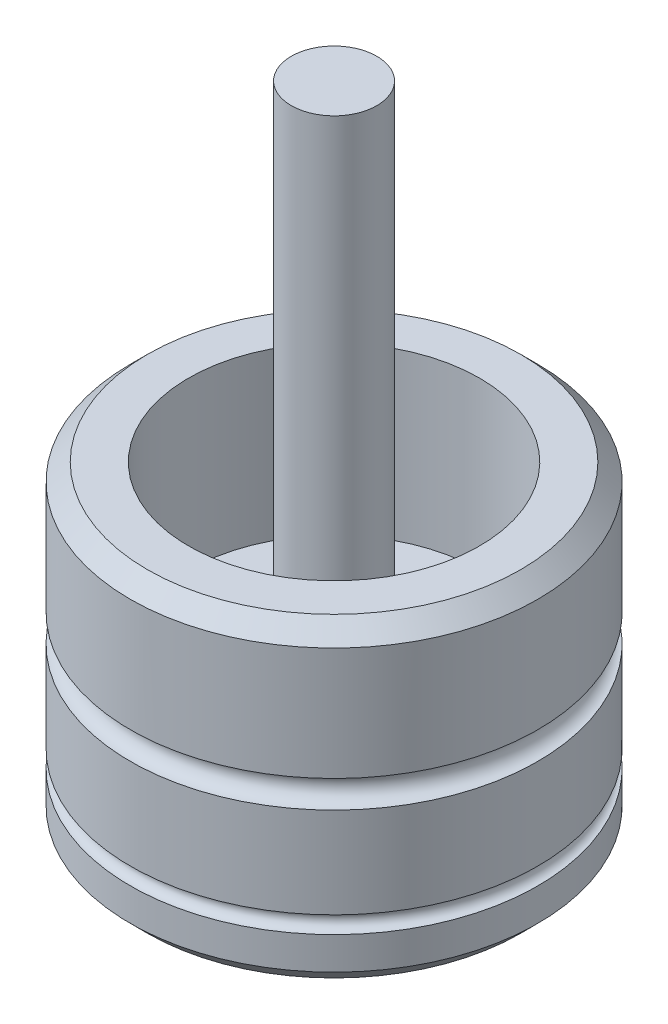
from build123d import *

# Parameters (mm, degrees)
CHAMFER1_SIZE       = 1.27
SKETCH2_R           = 3.175
BOSS_EXTRUDE1_DEPTH = 36.83


with BuildPart() as part:
    # Sketch1 → Revolve1 (revolve)
    with BuildSketch(Plane(origin=(0, 0, 0), x_dir=(0, 0, -1), z_dir=(1, 0, 0))):
        with BuildLine():
            Line((0, 0), (15.113, 0))
            Line((15.113, 0), (15.113, 3.683))
            ThreePointArc((15.113, 3.683), (14.478, 4.318), (15.113, 4.953))
            Line((15.113, 4.953), (15.113, 11.684))
            ThreePointArc((15.113, 11.684), (14.097, 12.7), (15.113, 13.716))
            Line((15.113, 13.716), (15.113, 23.368))
            Line((15.113, 23.368), (10.795, 23.368))
            Line((10.795, 23.368), (10.795, 11.026472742))
            Line((10.795, 11.026472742), (0, 11.026472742))
            Line((0, 11.026472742), (0, 0))
        make_face()
    revolve(axis=Axis((0, 0, 0), (0, 1, 0)))

    # Chamfer1
    chamfer1_edges = [part.edges().sort_by_distance(p)[0] for p in [
        (0, 0, 15.113),
        (0, 23.368, 15.113),
    ]]
    chamfer(chamfer1_edges, length=CHAMFER1_SIZE)

    # Sketch2 → Boss-Extrude1 (add)
    with BuildSketch(Plane(origin=(0, 11.026472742, 0), x_dir=(1, 0, 0), z_dir=(0, 1, 0))):
        with Locations(Location((0, 0, 0), (0, 0, 270))):
            Circle(SKETCH2_R)
    extrude(amount=BOSS_EXTRUDE1_DEPTH)


solid = part.part
